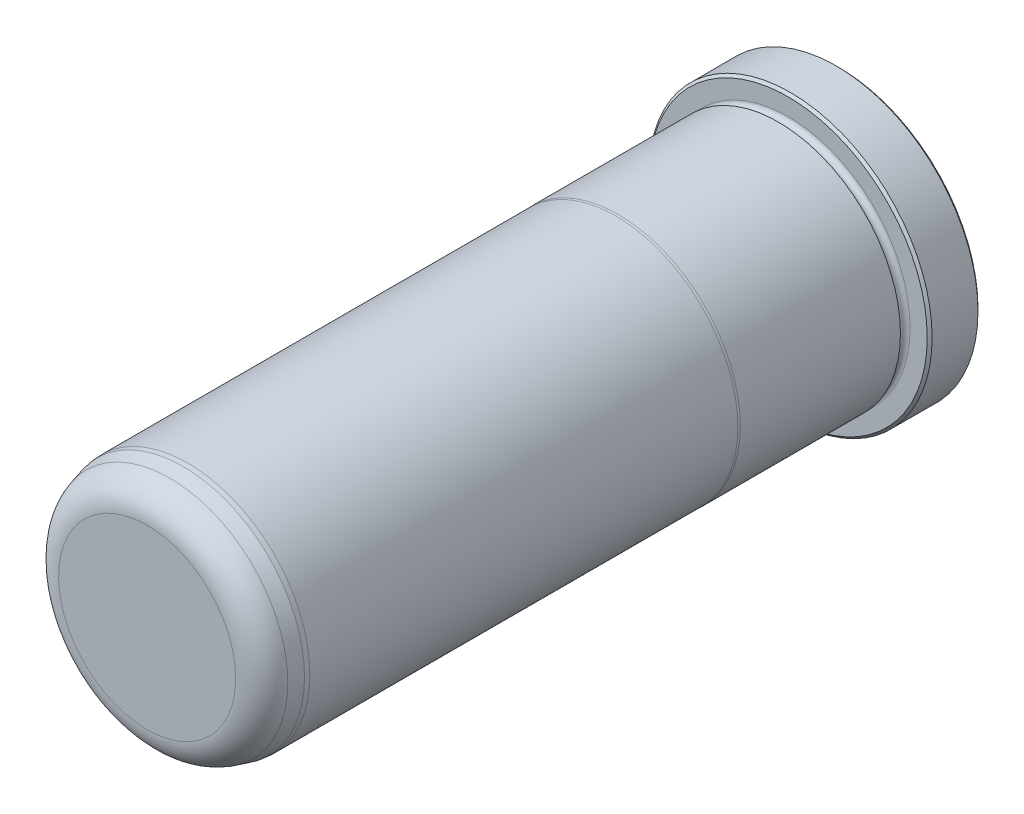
from build123d import *

# Parameters (mm, degrees)
FILLET6_R     = 4.7625
CHAMFER1_SIZE = 0.381


with BuildPart() as part:
    # Sketch1 → Revolve1 (revolve)
    with BuildSketch(Plane(origin=(0, 0, 0), x_dir=(0, 0, -1), z_dir=(1, 0, 0)), mode=Mode.PRIVATE) as revolve1_sk:
        with BuildLine():
            Line((0, 0), (0, 22.098))
            Line((0, 22.098), (-7.9248, 22.098))
            Line((-7.9248, 22.098), (-7.9248, 19.0373))
            ThreePointArc((-7.9248, 19.0373), (-8.6868, 18.2753), (-9.4488, 19.0373))
            Line((-9.4488, 19.0373), (-9.4488, 19.0627))
            Line((-9.4488, 19.0627), (-34.434763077, 19.0627))
            Line((-34.434763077, 19.0627), (-34.798, 19.0373))
            Line((-34.798, 19.0373), (-101.6, 19.0373))
            Line((-101.6, 19.0373), (-102.362, 18.970633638))
            Line((-102.362, 18.970633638), (-107.95, 17.473333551))
            Line((-107.95, 17.473333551), (-107.95, 0))
            Line((-107.95, 0), (0, 0))
        make_face()
    revolve(revolve1_sk.sketch.rotate(Axis((0, 0, 0), (0, 0, -1)), 90), axis=Axis((0, 0, 0), (0, 0, -1)))

    # Fillet6
    fillet6_edges = [part.edges().sort_by_distance(p)[0] for p in [
        (-17.473333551, 0, 107.95),
    ]]
    fillet(fillet6_edges, radius=FILLET6_R)

    # Chamfer1
    chamfer1_edges = [part.edges().sort_by_distance(p)[0] for p in [
        (-22.098, 0, 7.9248),
        (-22.098, 0, 0),
    ]]
    chamfer(chamfer1_edges, length=CHAMFER1_SIZE)


solid = part.part
